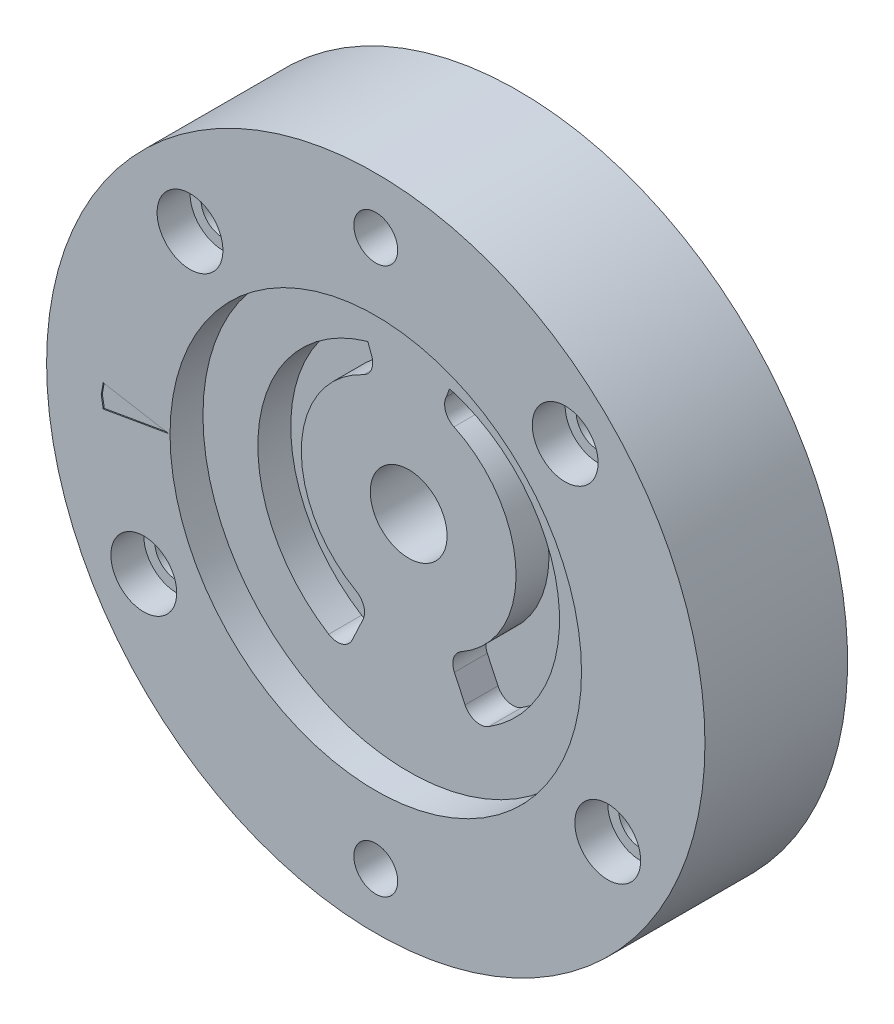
ISO-10303-21;
HEADER;
FILE_DESCRIPTION(('STEP AP214'),'2;1');
FILE_NAME('part.step','',(''),(''),'','','');
FILE_SCHEMA(('AUTOMOTIVE_DESIGN { 1 0 10303 214 1 1 1 1 }'));
ENDSEC;
DATA;
#1=APPLICATION_CONTEXT('core data for automotive mechanical design processes');
#2=APPLICATION_PROTOCOL_DEFINITION('international standard','automotive_design',2000,#1);
#3=PRODUCT_CONTEXT('',#1,'mechanical');
#4=PRODUCT('Part','Part','',(#3));
#5=PRODUCT_RELATED_PRODUCT_CATEGORY('part','',(#4));
#6=PRODUCT_DEFINITION_FORMATION('','',#4);
#7=PRODUCT_DEFINITION_CONTEXT('part definition',#1,'design');
#8=PRODUCT_DEFINITION('design','',#6,#7);
#9=PRODUCT_DEFINITION_SHAPE('','',#8);
#10=(LENGTH_UNIT() NAMED_UNIT(*) SI_UNIT(.MILLI.,.METRE.));
#11=(NAMED_UNIT(*) PLANE_ANGLE_UNIT() SI_UNIT($,.RADIAN.));
#12=(NAMED_UNIT(*) SI_UNIT($,.STERADIAN.) SOLID_ANGLE_UNIT());
#13=UNCERTAINTY_MEASURE_WITH_UNIT(LENGTH_MEASURE(1.E-05),#10,'distance_accuracy_value','');
#14=(GEOMETRIC_REPRESENTATION_CONTEXT(3) GLOBAL_UNCERTAINTY_ASSIGNED_CONTEXT((#13)) GLOBAL_UNIT_ASSIGNED_CONTEXT((#10,
#11,#12)) REPRESENTATION_CONTEXT('',''));
#15=CARTESIAN_POINT('',(0.,0.,0.));
#16=DIRECTION('',(0.,0.,1.));
#17=DIRECTION('',(1.,0.,0.));
#18=AXIS2_PLACEMENT_3D('',#15,#16,#17);
#19=CARTESIAN_POINT('',(-21.1403982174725,-12.2054146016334,3.));
#20=DIRECTION('',(0.,0.,-1.));
#21=DIRECTION('',(-1.,0.,0.));
#22=AXIS2_PLACEMENT_3D('',#19,#20,#21);
#23=CYLINDRICAL_SURFACE('',#22,2.00000000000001);
#24=CARTESIAN_POINT('',(-21.1403982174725,-12.2054146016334,-10.));
#25=DIRECTION('',(0.,0.,-1.));
#26=DIRECTION('',(-1.,0.,0.));
#27=AXIS2_PLACEMENT_3D('',#24,#25,#26);
#28=CIRCLE('',#27,2.00000000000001);
#29=CARTESIAN_POINT('',(-23.1403982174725,-12.2054146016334,-10.));
#30=VERTEX_POINT('',#29);
#31=EDGE_CURVE('E309',#30,#30,#28,.T.);
#32=ORIENTED_EDGE('',*,*,#31,.T.);
#33=EDGE_LOOP('',(#32));
#34=FACE_BOUND('',#33,.T.);
#35=CARTESIAN_POINT('',(-21.1403982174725,-12.2054146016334,0.));
#36=DIRECTION('',(0.,0.,1.));
#37=DIRECTION('',(1.,0.,0.));
#38=AXIS2_PLACEMENT_3D('',#35,#36,#37);
#39=CIRCLE('',#38,2.00000000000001);
#40=CARTESIAN_POINT('',(-19.1403982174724,-12.2054146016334,0.));
#41=VERTEX_POINT('',#40);
#42=EDGE_CURVE('E40',#41,#41,#39,.F.);
#43=ORIENTED_EDGE('',*,*,#42,.F.);
#44=EDGE_LOOP('',(#43));
#45=FACE_BOUND('',#44,.T.);
#46=ADVANCED_FACE('F36',(#34,#45),#23,.F.);
#47=CARTESIAN_POINT('',(21.1403982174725,-12.2054146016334,3.));
#48=DIRECTION('',(0.,0.,-1.));
#49=DIRECTION('',(-1.,0.,0.));
#50=AXIS2_PLACEMENT_3D('',#47,#48,#49);
#51=CYLINDRICAL_SURFACE('',#50,2.00000000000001);
#52=CARTESIAN_POINT('',(21.1403982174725,-12.2054146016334,-10.));
#53=DIRECTION('',(0.,0.,-1.));
#54=DIRECTION('',(1.,0.,0.));
#55=AXIS2_PLACEMENT_3D('',#52,#53,#54);
#56=CIRCLE('',#55,2.00000000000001);
#57=CARTESIAN_POINT('',(23.1403982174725,-12.2054146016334,-10.));
#58=VERTEX_POINT('',#57);
#59=EDGE_CURVE('E312',#58,#58,#56,.T.);
#60=ORIENTED_EDGE('',*,*,#59,.T.);
#61=EDGE_LOOP('',(#60));
#62=FACE_BOUND('',#61,.T.);
#63=CARTESIAN_POINT('',(21.1403982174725,-12.2054146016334,0.));
#64=DIRECTION('',(0.,0.,1.));
#65=DIRECTION('',(1.,0.,0.));
#66=AXIS2_PLACEMENT_3D('',#63,#64,#65);
#67=CIRCLE('',#66,2.00000000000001);
#68=CARTESIAN_POINT('',(23.1403982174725,-12.2054146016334,0.));
#69=VERTEX_POINT('',#68);
#70=EDGE_CURVE('E294',#69,#69,#67,.F.);
#71=ORIENTED_EDGE('',*,*,#70,.F.);
#72=EDGE_LOOP('',(#71));
#73=FACE_BOUND('',#72,.T.);
#74=ADVANCED_FACE('F388',(#62,#73),#51,.F.);
#75=CARTESIAN_POINT('',(17.2610628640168,17.2610628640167,3.));
#76=DIRECTION('',(0.,0.,-1.));
#77=DIRECTION('',(-1.,0.,0.));
#78=AXIS2_PLACEMENT_3D('',#75,#76,#77);
#79=CYLINDRICAL_SURFACE('',#78,2.00000000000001);
#80=CARTESIAN_POINT('',(17.2610628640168,17.2610628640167,-10.));
#81=DIRECTION('',(0.,0.,-1.));
#82=DIRECTION('',(-1.,0.,0.));
#83=AXIS2_PLACEMENT_3D('',#80,#81,#82);
#84=CIRCLE('',#83,2.00000000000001);
#85=CARTESIAN_POINT('',(15.2610628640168,17.2610628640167,-10.));
#86=VERTEX_POINT('',#85);
#87=EDGE_CURVE('E324',#86,#86,#84,.T.);
#88=ORIENTED_EDGE('',*,*,#87,.T.);
#89=EDGE_LOOP('',(#88));
#90=FACE_BOUND('',#89,.T.);
#91=CARTESIAN_POINT('',(17.2610628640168,17.2610628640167,0.));
#92=DIRECTION('',(0.,0.,1.));
#93=DIRECTION('',(1.,0.,0.));
#94=AXIS2_PLACEMENT_3D('',#91,#92,#93);
#95=CIRCLE('',#94,2.00000000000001);
#96=CARTESIAN_POINT('',(19.2610628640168,17.2610628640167,0.));
#97=VERTEX_POINT('',#96);
#98=EDGE_CURVE('E301',#97,#97,#95,.F.);
#99=ORIENTED_EDGE('',*,*,#98,.F.);
#100=EDGE_LOOP('',(#99));
#101=FACE_BOUND('',#100,.T.);
#102=ADVANCED_FACE('F390',(#90,#101),#79,.F.);
#103=CARTESIAN_POINT('',(-16.9287019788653,16.9287019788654,3.));
#104=DIRECTION('',(0.,0.,-1.));
#105=DIRECTION('',(-1.,0.,0.));
#106=AXIS2_PLACEMENT_3D('',#103,#104,#105);
#107=CYLINDRICAL_SURFACE('',#106,2.00000000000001);
#108=CARTESIAN_POINT('',(-16.9287019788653,16.9287019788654,-10.));
#109=DIRECTION('',(0.,0.,-1.));
#110=DIRECTION('',(1.,0.,0.));
#111=AXIS2_PLACEMENT_3D('',#108,#109,#110);
#112=CIRCLE('',#111,2.00000000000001);
#113=CARTESIAN_POINT('',(-14.9287019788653,16.9287019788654,-10.));
#114=VERTEX_POINT('',#113);
#115=EDGE_CURVE('E321',#114,#114,#112,.T.);
#116=ORIENTED_EDGE('',*,*,#115,.T.);
#117=EDGE_LOOP('',(#116));
#118=FACE_BOUND('',#117,.T.);
#119=CARTESIAN_POINT('',(-16.9287019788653,16.9287019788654,0.));
#120=DIRECTION('',(0.,0.,1.));
#121=DIRECTION('',(1.,0.,0.));
#122=AXIS2_PLACEMENT_3D('',#119,#120,#121);
#123=CIRCLE('',#122,2.00000000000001);
#124=CARTESIAN_POINT('',(-14.9287019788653,16.9287019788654,0.));
#125=VERTEX_POINT('',#124);
#126=EDGE_CURVE('E308',#125,#125,#123,.F.);
#127=ORIENTED_EDGE('',*,*,#126,.F.);
#128=EDGE_LOOP('',(#127));
#129=FACE_BOUND('',#128,.T.);
#130=ADVANCED_FACE('F397',(#118,#129),#107,.F.);
#131=CARTESIAN_POINT('',(0.,0.,3.));
#132=DIRECTION('',(0.,0.,1.));
#133=DIRECTION('',(1.,0.,0.));
#134=AXIS2_PLACEMENT_3D('',#131,#132,#133);
#135=PLANE('',#134);
#136=CARTESIAN_POINT('',(-21.1403982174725,-12.2054146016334,3.));
#137=DIRECTION('',(0.,0.,1.));
#138=DIRECTION('',(1.,0.,0.));
#139=AXIS2_PLACEMENT_3D('',#136,#137,#138);
#140=CIRCLE('',#139,3.);
#141=CARTESIAN_POINT('',(-18.1403982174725,-12.2054146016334,3.));
#142=VERTEX_POINT('',#141);
#143=EDGE_CURVE('E271',#142,#142,#140,.T.);
#144=ORIENTED_EDGE('',*,*,#143,.F.);
#145=EDGE_LOOP('',(#144));
#146=FACE_BOUND('',#145,.T.);
#147=CARTESIAN_POINT('',(21.1403982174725,-12.2054146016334,3.));
#148=DIRECTION('',(0.,0.,1.));
#149=DIRECTION('',(1.,0.,0.));
#150=AXIS2_PLACEMENT_3D('',#147,#148,#149);
#151=CIRCLE('',#150,3.);
#152=CARTESIAN_POINT('',(24.1403982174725,-12.2054146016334,3.));
#153=VERTEX_POINT('',#152);
#154=EDGE_CURVE('E288',#153,#153,#151,.T.);
#155=ORIENTED_EDGE('',*,*,#154,.F.);
#156=EDGE_LOOP('',(#155));
#157=FACE_BOUND('',#156,.T.);
#158=CARTESIAN_POINT('',(17.2610628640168,17.2610628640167,3.));
#159=DIRECTION('',(0.,0.,1.));
#160=DIRECTION('',(1.,0.,0.));
#161=AXIS2_PLACEMENT_3D('',#158,#159,#160);
#162=CIRCLE('',#161,3.);
#163=CARTESIAN_POINT('',(20.2610628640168,17.2610628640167,3.));
#164=VERTEX_POINT('',#163);
#165=EDGE_CURVE('E295',#164,#164,#162,.T.);
#166=ORIENTED_EDGE('',*,*,#165,.F.);
#167=EDGE_LOOP('',(#166));
#168=FACE_BOUND('',#167,.T.);
#169=CARTESIAN_POINT('',(-16.9287019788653,16.9287019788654,3.));
#170=DIRECTION('',(0.,0.,1.));
#171=DIRECTION('',(1.,0.,0.));
#172=AXIS2_PLACEMENT_3D('',#169,#170,#171);
#173=CIRCLE('',#172,3.);
#174=CARTESIAN_POINT('',(-13.9287019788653,16.9287019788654,3.));
#175=VERTEX_POINT('',#174);
#176=EDGE_CURVE('E302',#175,#175,#173,.T.);
#177=ORIENTED_EDGE('',*,*,#176,.F.);
#178=EDGE_LOOP('',(#177));
#179=FACE_BOUND('',#178,.T.);
#180=CARTESIAN_POINT('',(0.,-24.9027237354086,3.));
#181=DIRECTION('',(0.,0.,-1.));
#182=DIRECTION('',(1.,0.,0.));
#183=AXIS2_PLACEMENT_3D('',#180,#181,#182);
#184=CIRCLE('',#183,2.);
#185=CARTESIAN_POINT('',(2.,-24.9027237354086,3.));
#186=VERTEX_POINT('',#185);
#187=EDGE_CURVE('E318',#186,#186,#184,.T.);
#188=ORIENTED_EDGE('',*,*,#187,.T.);
#189=EDGE_LOOP('',(#188));
#190=FACE_BOUND('',#189,.T.);
#191=CARTESIAN_POINT('',(0.,24.9027237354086,3.));
#192=DIRECTION('',(0.,0.,-1.));
#193=DIRECTION('',(-1.,0.,0.));
#194=AXIS2_PLACEMENT_3D('',#191,#192,#193);
#195=CIRCLE('',#194,2.);
#196=CARTESIAN_POINT('',(-2.,24.9027237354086,3.));
#197=VERTEX_POINT('',#196);
#198=EDGE_CURVE('E330',#197,#197,#195,.T.);
#199=ORIENTED_EDGE('',*,*,#198,.T.);
#200=EDGE_LOOP('',(#199));
#201=FACE_BOUND('',#200,.T.);
#202=DIRECTION('',(0.985211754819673,0.171341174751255,0.));
#203=VECTOR('',#202,1.);
#204=CARTESIAN_POINT('',(-18.8715953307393,0.,3.));
#205=LINE('',#204,#203);
#206=CARTESIAN_POINT('',(-24.8378728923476,-1.0376134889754,3.));
#207=VERTEX_POINT('',#206);
#208=CARTESIAN_POINT('',(-18.8715953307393,0.,3.));
#209=VERTEX_POINT('',#208);
#210=EDGE_CURVE('E333',#207,#209,#205,.T.);
#211=ORIENTED_EDGE('',*,*,#210,.F.);
#212=DIRECTION('',(0.171341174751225,-0.985211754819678,0.));
#213=VECTOR('',#212,1.);
#214=CARTESIAN_POINT('',(-24.8378728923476,-1.0376134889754,3.));
#215=LINE('',#214,#213);
#216=CARTESIAN_POINT('',(-25.0183274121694,0.,3.));
#217=VERTEX_POINT('',#216);
#218=EDGE_CURVE('E341',#217,#207,#215,.T.);
#219=ORIENTED_EDGE('',*,*,#218,.F.);
#220=DIRECTION('',(-0.171341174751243,-0.985211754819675,0.));
#221=VECTOR('',#220,1.);
#222=CARTESIAN_POINT('',(-24.8378728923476,1.0376134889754,3.));
#223=LINE('',#222,#221);
#224=CARTESIAN_POINT('',(-24.8378728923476,1.0376134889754,3.));
#225=VERTEX_POINT('',#224);
#226=EDGE_CURVE('E338',#225,#217,#223,.T.);
#227=ORIENTED_EDGE('',*,*,#226,.F.);
#228=DIRECTION('',(-0.985211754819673,0.171341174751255,0.));
#229=VECTOR('',#228,1.);
#230=CARTESIAN_POINT('',(-18.8715953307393,0.,3.));
#231=LINE('',#230,#229);
#232=EDGE_CURVE('E335',#209,#225,#231,.T.);
#233=ORIENTED_EDGE('',*,*,#232,.F.);
#234=EDGE_LOOP('',(#211,#219,#227,#233));
#235=FACE_BOUND('',#234,.T.);
#236=CARTESIAN_POINT('',(0.,0.,3.));
#237=DIRECTION('',(0.,0.,1.));
#238=DIRECTION('',(1.,0.,0.));
#239=AXIS2_PLACEMENT_3D('',#236,#237,#238);
#240=CIRCLE('',#239,30.);
#241=CARTESIAN_POINT('',(30.,0.,3.));
#242=VERTEX_POINT('',#241);
#243=EDGE_CURVE('E12',#242,#242,#240,.T.);
#244=ORIENTED_EDGE('',*,*,#243,.T.);
#245=EDGE_LOOP('',(#244));
#246=FACE_BOUND('',#245,.T.);
#247=CARTESIAN_POINT('',(0.,0.,3.));
#248=DIRECTION('',(0.,0.,1.));
#249=DIRECTION('',(1.,0.,0.));
#250=AXIS2_PLACEMENT_3D('',#247,#248,#249);
#251=CIRCLE('',#250,18.75);
#252=CARTESIAN_POINT('',(18.75,0.,3.));
#253=VERTEX_POINT('',#252);
#254=EDGE_CURVE('E46',#253,#253,#251,.T.);
#255=ORIENTED_EDGE('',*,*,#254,.F.);
#256=EDGE_LOOP('',(#255));
#257=FACE_BOUND('',#256,.T.);
#258=ADVANCED_FACE('F411',(#146,#157,#168,#179,#190,#201,#235,#246,#257),#135,.T.);
#259=CARTESIAN_POINT('',(0.,0.,3.));
#260=DIRECTION('',(0.,0.,-1.));
#261=DIRECTION('',(-1.,0.,0.));
#262=AXIS2_PLACEMENT_3D('',#259,#260,#261);
#263=CYLINDRICAL_SURFACE('',#262,30.);
#264=ORIENTED_EDGE('',*,*,#243,.F.);
#265=EDGE_LOOP('',(#264));
#266=FACE_BOUND('',#265,.T.);
#267=CARTESIAN_POINT('',(0.,0.,-10.));
#268=DIRECTION('',(0.,0.,-1.));
#269=DIRECTION('',(-1.,0.,0.));
#270=AXIS2_PLACEMENT_3D('',#267,#268,#269);
#271=CIRCLE('',#270,30.);
#272=CARTESIAN_POINT('',(-30.,0.,-10.));
#273=VERTEX_POINT('',#272);
#274=EDGE_CURVE('E371',#273,#273,#271,.T.);
#275=ORIENTED_EDGE('',*,*,#274,.F.);
#276=EDGE_LOOP('',(#275));
#277=FACE_BOUND('',#276,.T.);
#278=ADVANCED_FACE('F38',(#266,#277),#263,.T.);
#279=CARTESIAN_POINT('',(0.,0.,3.));
#280=DIRECTION('',(0.,0.,-1.));
#281=DIRECTION('',(-1.,0.,0.));
#282=AXIS2_PLACEMENT_3D('',#279,#280,#281);
#283=CYLINDRICAL_SURFACE('',#282,18.75);
#284=ORIENTED_EDGE('',*,*,#254,.T.);
#285=EDGE_LOOP('',(#284));
#286=FACE_BOUND('',#285,.T.);
#287=CARTESIAN_POINT('',(0.,0.,0.));
#288=DIRECTION('',(0.,0.,1.));
#289=DIRECTION('',(1.,0.,0.));
#290=AXIS2_PLACEMENT_3D('',#287,#288,#289);
#291=CIRCLE('',#290,18.75);
#292=CARTESIAN_POINT('',(18.75,0.,0.));
#293=VERTEX_POINT('',#292);
#294=EDGE_CURVE('E374',#293,#293,#291,.T.);
#295=ORIENTED_EDGE('',*,*,#294,.F.);
#296=EDGE_LOOP('',(#295));
#297=FACE_BOUND('',#296,.T.);
#298=ADVANCED_FACE('F446',(#286,#297),#283,.F.);
#299=CARTESIAN_POINT('',(0.,0.,-10.));
#300=DIRECTION('',(0.,0.,-1.));
#301=DIRECTION('',(-1.,0.,0.));
#302=AXIS2_PLACEMENT_3D('',#299,#300,#301);
#303=PLANE('',#302);
#304=ORIENTED_EDGE('',*,*,#31,.F.);
#305=EDGE_LOOP('',(#304));
#306=FACE_BOUND('',#305,.T.);
#307=ORIENTED_EDGE('',*,*,#59,.F.);
#308=EDGE_LOOP('',(#307));
#309=FACE_BOUND('',#308,.T.);
#310=CARTESIAN_POINT('',(0.,-24.9027237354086,-10.));
#311=DIRECTION('',(0.,0.,-1.));
#312=DIRECTION('',(1.,0.,0.));
#313=AXIS2_PLACEMENT_3D('',#310,#311,#312);
#314=CIRCLE('',#313,2.);
#315=CARTESIAN_POINT('',(2.,-24.9027237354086,-10.));
#316=VERTEX_POINT('',#315);
#317=EDGE_CURVE('E315',#316,#316,#314,.T.);
#318=ORIENTED_EDGE('',*,*,#317,.F.);
#319=EDGE_LOOP('',(#318));
#320=FACE_BOUND('',#319,.T.);
#321=ORIENTED_EDGE('',*,*,#115,.F.);
#322=EDGE_LOOP('',(#321));
#323=FACE_BOUND('',#322,.T.);
#324=ORIENTED_EDGE('',*,*,#87,.F.);
#325=EDGE_LOOP('',(#324));
#326=FACE_BOUND('',#325,.T.);
#327=CARTESIAN_POINT('',(0.,24.9027237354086,-10.));
#328=DIRECTION('',(0.,0.,-1.));
#329=DIRECTION('',(-1.,0.,0.));
#330=AXIS2_PLACEMENT_3D('',#327,#328,#329);
#331=CIRCLE('',#330,2.);
#332=CARTESIAN_POINT('',(-2.,24.9027237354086,-10.));
#333=VERTEX_POINT('',#332);
#334=EDGE_CURVE('E327',#333,#333,#331,.T.);
#335=ORIENTED_EDGE('',*,*,#334,.F.);
#336=EDGE_LOOP('',(#335));
#337=FACE_BOUND('',#336,.T.);
#338=ORIENTED_EDGE('',*,*,#274,.T.);
#339=EDGE_LOOP('',(#338));
#340=FACE_BOUND('',#339,.T.);
#341=CARTESIAN_POINT('',(0.,1.6,-10.));
#342=DIRECTION('',(0.,0.,-1.));
#343=DIRECTION('',(-1.,0.,0.));
#344=AXIS2_PLACEMENT_3D('',#341,#342,#343);
#345=CIRCLE('',#344,3.5);
#346=CARTESIAN_POINT('',(-3.5,1.6,-10.));
#347=VERTEX_POINT('',#346);
#348=EDGE_CURVE('E368',#347,#347,#345,.T.);
#349=ORIENTED_EDGE('',*,*,#348,.F.);
#350=EDGE_LOOP('',(#349));
#351=FACE_BOUND('',#350,.T.);
#352=ADVANCED_FACE('F443',(#306,#309,#320,#323,#326,#337,#340,#351),#303,.T.);
#353=CARTESIAN_POINT('',(0.,0.,0.));
#354=DIRECTION('',(0.,0.,-1.));
#355=DIRECTION('',(-1.,0.,0.));
#356=AXIS2_PLACEMENT_3D('',#353,#354,#355);
#357=PLANE('',#356);
#358=DIRECTION('',(0.422618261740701,-0.906307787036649,0.));
#359=VECTOR('',#358,1.);
#360=CARTESIAN_POINT('',(4.16463917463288,-8.81825706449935,0.));
#361=LINE('',#360,#359);
#362=CARTESIAN_POINT('',(4.16463917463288,-8.81825706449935,0.));
#363=VERTEX_POINT('',#362);
#364=CARTESIAN_POINT('',(5.13698260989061,-10.9034542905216,0.));
#365=VERTEX_POINT('',#364);
#366=EDGE_CURVE('E178',#363,#365,#361,.T.);
#367=ORIENTED_EDGE('',*,*,#366,.F.);
#368=CARTESIAN_POINT('',(5.52410085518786,-8.18432967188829,0.));
#369=DIRECTION('',(0.,0.,1.));
#370=DIRECTION('',(-1.,0.,0.));
#371=AXIS2_PLACEMENT_3D('',#368,#369,#370);
#372=CIRCLE('',#371,1.5);
#373=CARTESIAN_POINT('',(4.78989806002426,-6.87629822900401,0.));
#374=VERTEX_POINT('',#373);
#375=EDGE_CURVE('E53',#374,#363,#372,.T.);
#376=ORIENTED_EDGE('',*,*,#375,.F.);
#377=CARTESIAN_POINT('',(0.,1.65722590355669,0.));
#378=DIRECTION('',(0.,0.,-1.));
#379=DIRECTION('',(-1.,0.,0.));
#380=AXIS2_PLACEMENT_3D('',#377,#378,#379);
#381=CIRCLE('',#380,9.78591628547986);
#382=CARTESIAN_POINT('',(4.12384270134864,10.53180076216,0.));
#383=VERTEX_POINT('',#382);
#384=EDGE_CURVE('E197',#383,#374,#381,.T.);
#385=ORIENTED_EDGE('',*,*,#384,.F.);
#386=CARTESIAN_POINT('',(4.77508505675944,11.8830532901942,0.));
#387=DIRECTION('',(0.,0.,1.));
#388=DIRECTION('',(1.,0.,0.));
#389=AXIS2_PLACEMENT_3D('',#386,#387,#388);
#390=CIRCLE('',#389,1.5);
#391=CARTESIAN_POINT('',(3.43996672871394,12.5667630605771,0.));
#392=VERTEX_POINT('',#391);
#393=EDGE_CURVE('E194',#392,#383,#390,.T.);
#394=ORIENTED_EDGE('',*,*,#393,.F.);
#395=DIRECTION('',(-0.342020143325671,-0.939692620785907,0.));
#396=VECTOR('',#395,1.);
#397=CARTESIAN_POINT('',(3.43996672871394,12.5667630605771,0.));
#398=LINE('',#397,#396);
#399=CARTESIAN_POINT('',(3.72368256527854,13.34626591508,0.));
#400=VERTEX_POINT('',#399);
#401=EDGE_CURVE('E188',#400,#392,#398,.T.);
#402=ORIENTED_EDGE('',*,*,#401,.F.);
#403=CARTESIAN_POINT('',(0.,0.112840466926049,0.));
#404=DIRECTION('',(0.,0.,1.));
#405=DIRECTION('',(1.,0.,0.));
#406=AXIS2_PLACEMENT_3D('',#403,#404,#405);
#407=CIRCLE('',#406,13.7473401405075);
#408=CARTESIAN_POINT('',(7.29210002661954,-11.5411132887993,0.));
#409=VERTEX_POINT('',#408);
#410=EDGE_CURVE('E186',#409,#400,#407,.T.);
#411=ORIENTED_EDGE('',*,*,#410,.F.);
#412=CARTESIAN_POINT('',(6.49644429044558,-10.2695268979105,0.));
#413=DIRECTION('',(0.,0.,1.));
#414=DIRECTION('',(1.,0.,0.));
#415=AXIS2_PLACEMENT_3D('',#412,#413,#414);
#416=CIRCLE('',#415,1.5);
#417=EDGE_CURVE('E167',#365,#409,#416,.T.);
#418=ORIENTED_EDGE('',*,*,#417,.F.);
#419=EDGE_LOOP('',(#367,#376,#385,#394,#402,#411,#418));
#420=FACE_BOUND('',#419,.T.);
#421=DIRECTION('',(0.422618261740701,0.906307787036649,0.));
#422=VECTOR('',#421,1.);
#423=CARTESIAN_POINT('',(-4.16463917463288,-8.81825706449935,0.));
#424=LINE('',#423,#422);
#425=CARTESIAN_POINT('',(-5.1369826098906,-10.9034542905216,0.));
#426=VERTEX_POINT('',#425);
#427=CARTESIAN_POINT('',(-4.16463917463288,-8.81825706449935,0.));
#428=VERTEX_POINT('',#427);
#429=EDGE_CURVE('E229',#426,#428,#424,.T.);
#430=ORIENTED_EDGE('',*,*,#429,.F.);
#431=CARTESIAN_POINT('',(-6.49644429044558,-10.2695268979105,0.));
#432=DIRECTION('',(0.,0.,1.));
#433=DIRECTION('',(-1.,0.,0.));
#434=AXIS2_PLACEMENT_3D('',#431,#432,#433);
#435=CIRCLE('',#434,1.5);
#436=CARTESIAN_POINT('',(-7.29210002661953,-11.5411132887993,0.));
#437=VERTEX_POINT('',#436);
#438=EDGE_CURVE('E61',#437,#426,#435,.T.);
#439=ORIENTED_EDGE('',*,*,#438,.F.);
#440=CARTESIAN_POINT('',(0.,0.112840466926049,0.));
#441=DIRECTION('',(0.,0.,1.));
#442=DIRECTION('',(-1.,0.,0.));
#443=AXIS2_PLACEMENT_3D('',#440,#441,#442);
#444=CIRCLE('',#443,13.7473401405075);
#445=CARTESIAN_POINT('',(-3.72368256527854,13.34626591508,0.));
#446=VERTEX_POINT('',#445);
#447=EDGE_CURVE('E244',#446,#437,#444,.T.);
#448=ORIENTED_EDGE('',*,*,#447,.F.);
#449=DIRECTION('',(-0.342020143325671,0.939692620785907,0.));
#450=VECTOR('',#449,1.);
#451=CARTESIAN_POINT('',(-3.43996672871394,12.5667630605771,0.));
#452=LINE('',#451,#450);
#453=CARTESIAN_POINT('',(-3.43996672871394,12.5667630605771,0.));
#454=VERTEX_POINT('',#453);
#455=EDGE_CURVE('E241',#454,#446,#452,.T.);
#456=ORIENTED_EDGE('',*,*,#455,.F.);
#457=CARTESIAN_POINT('',(-4.77508505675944,11.8830532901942,0.));
#458=DIRECTION('',(0.,0.,1.));
#459=DIRECTION('',(-1.,0.,0.));
#460=AXIS2_PLACEMENT_3D('',#457,#458,#459);
#461=CIRCLE('',#460,1.5);
#462=CARTESIAN_POINT('',(-4.12384270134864,10.53180076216,0.));
#463=VERTEX_POINT('',#462);
#464=EDGE_CURVE('E238',#463,#454,#461,.T.);
#465=ORIENTED_EDGE('',*,*,#464,.F.);
#466=CARTESIAN_POINT('',(0.,1.65722590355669,0.));
#467=DIRECTION('',(0.,0.,-1.));
#468=DIRECTION('',(1.,0.,0.));
#469=AXIS2_PLACEMENT_3D('',#466,#467,#468);
#470=CIRCLE('',#469,9.78591628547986);
#471=CARTESIAN_POINT('',(-4.78989806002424,-6.87629822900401,0.));
#472=VERTEX_POINT('',#471);
#473=EDGE_CURVE('E235',#472,#463,#470,.T.);
#474=ORIENTED_EDGE('',*,*,#473,.F.);
#475=CARTESIAN_POINT('',(-5.52410085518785,-8.1843296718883,0.));
#476=DIRECTION('',(0.,0.,1.));
#477=DIRECTION('',(1.,0.,0.));
#478=AXIS2_PLACEMENT_3D('',#475,#476,#477);
#479=CIRCLE('',#478,1.5);
#480=EDGE_CURVE('E232',#428,#472,#479,.T.);
#481=ORIENTED_EDGE('',*,*,#480,.F.);
#482=EDGE_LOOP('',(#430,#439,#448,#456,#465,#474,#481));
#483=FACE_BOUND('',#482,.T.);
#484=ORIENTED_EDGE('',*,*,#294,.T.);
#485=EDGE_LOOP('',(#484));
#486=FACE_BOUND('',#485,.T.);
#487=CARTESIAN_POINT('',(0.,1.6,0.));
#488=DIRECTION('',(0.,0.,-1.));
#489=DIRECTION('',(-1.,0.,0.));
#490=AXIS2_PLACEMENT_3D('',#487,#488,#489);
#491=CIRCLE('',#490,3.5);
#492=CARTESIAN_POINT('',(-3.5,1.6,0.));
#493=VERTEX_POINT('',#492);
#494=EDGE_CURVE('E359',#493,#493,#491,.T.);
#495=ORIENTED_EDGE('',*,*,#494,.T.);
#496=EDGE_LOOP('',(#495));
#497=FACE_BOUND('',#496,.T.);
#498=ADVANCED_FACE('F182',(#420,#483,#486,#497),#357,.F.);
#499=CARTESIAN_POINT('',(0.,1.6,-10.));
#500=DIRECTION('',(0.,0.,1.));
#501=DIRECTION('',(1.,0.,0.));
#502=AXIS2_PLACEMENT_3D('',#499,#500,#501);
#503=CYLINDRICAL_SURFACE('',#502,3.5);
#504=ORIENTED_EDGE('',*,*,#348,.T.);
#505=EDGE_LOOP('',(#504));
#506=FACE_BOUND('',#505,.T.);
#507=ORIENTED_EDGE('',*,*,#494,.F.);
#508=EDGE_LOOP('',(#507));
#509=FACE_BOUND('',#508,.T.);
#510=ADVANCED_FACE('F436',(#506,#509),#503,.F.);
#511=CARTESIAN_POINT('',(-18.8715953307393,0.,2.9));
#512=DIRECTION('',(0.171341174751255,-0.985211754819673,0.));
#513=DIRECTION('',(0.985211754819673,0.171341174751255,0.));
#514=AXIS2_PLACEMENT_3D('',#511,#512,#513);
#515=PLANE('',#514);
#516=ORIENTED_EDGE('',*,*,#210,.T.);
#517=DIRECTION('',(0.,0.,1.));
#518=VECTOR('',#517,1.);
#519=CARTESIAN_POINT('',(-18.8715953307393,0.,2.9));
#520=LINE('',#519,#518);
#521=CARTESIAN_POINT('',(-18.8715953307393,0.,2.9));
#522=VERTEX_POINT('',#521);
#523=EDGE_CURVE('E356',#522,#209,#520,.T.);
#524=ORIENTED_EDGE('',*,*,#523,.F.);
#525=DIRECTION('',(0.985211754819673,0.171341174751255,0.));
#526=VECTOR('',#525,1.);
#527=CARTESIAN_POINT('',(-18.8715953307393,0.,2.9));
#528=LINE('',#527,#526);
#529=CARTESIAN_POINT('',(-24.8378728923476,-1.0376134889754,2.9));
#530=VERTEX_POINT('',#529);
#531=EDGE_CURVE('E344',#530,#522,#528,.T.);
#532=ORIENTED_EDGE('',*,*,#531,.F.);
#533=DIRECTION('',(0.,0.,1.));
#534=VECTOR('',#533,1.);
#535=CARTESIAN_POINT('',(-24.8378728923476,-1.0376134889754,2.9));
#536=LINE('',#535,#534);
#537=EDGE_CURVE('E357',#530,#207,#536,.T.);
#538=ORIENTED_EDGE('',*,*,#537,.T.);
#539=EDGE_LOOP('',(#516,#524,#532,#538));
#540=FACE_BOUND('',#539,.T.);
#541=ADVANCED_FACE('F426',(#540),#515,.F.);
#542=CARTESIAN_POINT('',(-24.8378728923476,-1.0376134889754,2.9));
#543=DIRECTION('',(-0.985211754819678,-0.171341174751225,0.));
#544=DIRECTION('',(0.171341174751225,-0.985211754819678,0.));
#545=AXIS2_PLACEMENT_3D('',#542,#543,#544);
#546=PLANE('',#545);
#547=ORIENTED_EDGE('',*,*,#218,.T.);
#548=ORIENTED_EDGE('',*,*,#537,.F.);
#549=DIRECTION('',(0.171341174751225,-0.985211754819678,0.));
#550=VECTOR('',#549,1.);
#551=CARTESIAN_POINT('',(-24.8378728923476,-1.0376134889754,2.9));
#552=LINE('',#551,#550);
#553=CARTESIAN_POINT('',(-25.0183274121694,0.,2.9));
#554=VERTEX_POINT('',#553);
#555=EDGE_CURVE('E353',#554,#530,#552,.T.);
#556=ORIENTED_EDGE('',*,*,#555,.F.);
#557=DIRECTION('',(0.,0.,1.));
#558=VECTOR('',#557,1.);
#559=CARTESIAN_POINT('',(-25.0183274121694,0.,2.9));
#560=LINE('',#559,#558);
#561=EDGE_CURVE('E360',#554,#217,#560,.T.);
#562=ORIENTED_EDGE('',*,*,#561,.T.);
#563=EDGE_LOOP('',(#547,#548,#556,#562));
#564=FACE_BOUND('',#563,.T.);
#565=ADVANCED_FACE('F422',(#564),#546,.F.);
#566=CARTESIAN_POINT('',(-24.8378728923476,1.0376134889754,2.9));
#567=DIRECTION('',(-0.985211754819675,0.171341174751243,0.));
#568=DIRECTION('',(-0.171341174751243,-0.985211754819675,0.));
#569=AXIS2_PLACEMENT_3D('',#566,#567,#568);
#570=PLANE('',#569);
#571=ORIENTED_EDGE('',*,*,#226,.T.);
#572=ORIENTED_EDGE('',*,*,#561,.F.);
#573=DIRECTION('',(-0.171341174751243,-0.985211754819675,0.));
#574=VECTOR('',#573,1.);
#575=CARTESIAN_POINT('',(-24.8378728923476,1.0376134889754,2.9));
#576=LINE('',#575,#574);
#577=CARTESIAN_POINT('',(-24.8378728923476,1.0376134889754,2.9));
#578=VERTEX_POINT('',#577);
#579=EDGE_CURVE('E350',#578,#554,#576,.T.);
#580=ORIENTED_EDGE('',*,*,#579,.F.);
#581=DIRECTION('',(0.,0.,1.));
#582=VECTOR('',#581,1.);
#583=CARTESIAN_POINT('',(-24.8378728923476,1.0376134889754,2.9));
#584=LINE('',#583,#582);
#585=EDGE_CURVE('E362',#578,#225,#584,.T.);
#586=ORIENTED_EDGE('',*,*,#585,.T.);
#587=EDGE_LOOP('',(#571,#572,#580,#586));
#588=FACE_BOUND('',#587,.T.);
#589=ADVANCED_FACE('F425',(#588),#570,.F.);
#590=CARTESIAN_POINT('',(-18.8715953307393,0.,2.9));
#591=DIRECTION('',(0.171341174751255,0.985211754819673,0.));
#592=DIRECTION('',(-0.985211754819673,0.171341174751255,0.));
#593=AXIS2_PLACEMENT_3D('',#590,#591,#592);
#594=PLANE('',#593);
#595=ORIENTED_EDGE('',*,*,#232,.T.);
#596=ORIENTED_EDGE('',*,*,#585,.F.);
#597=DIRECTION('',(-0.985211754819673,0.171341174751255,0.));
#598=VECTOR('',#597,1.);
#599=CARTESIAN_POINT('',(-18.8715953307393,0.,2.9));
#600=LINE('',#599,#598);
#601=EDGE_CURVE('E347',#522,#578,#600,.T.);
#602=ORIENTED_EDGE('',*,*,#601,.F.);
#603=ORIENTED_EDGE('',*,*,#523,.T.);
#604=EDGE_LOOP('',(#595,#596,#602,#603));
#605=FACE_BOUND('',#604,.T.);
#606=ADVANCED_FACE('F420',(#605),#594,.F.);
#607=CARTESIAN_POINT('',(-24.8378728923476,-1.0376134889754,2.9));
#608=DIRECTION('',(0.,0.,-1.));
#609=DIRECTION('',(-1.,0.,0.));
#610=AXIS2_PLACEMENT_3D('',#607,#608,#609);
#611=PLANE('',#610);
#612=ORIENTED_EDGE('',*,*,#531,.T.);
#613=ORIENTED_EDGE('',*,*,#601,.T.);
#614=ORIENTED_EDGE('',*,*,#579,.T.);
#615=ORIENTED_EDGE('',*,*,#555,.T.);
#616=EDGE_LOOP('',(#612,#613,#614,#615));
#617=FACE_BOUND('',#616,.T.);
#618=ADVANCED_FACE('F416',(#617),#611,.F.);
#619=CARTESIAN_POINT('',(0.,24.9027237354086,3.));
#620=DIRECTION('',(0.,0.,-1.));
#621=DIRECTION('',(-1.,0.,0.));
#622=AXIS2_PLACEMENT_3D('',#619,#620,#621);
#623=CYLINDRICAL_SURFACE('',#622,2.);
#624=ORIENTED_EDGE('',*,*,#198,.F.);
#625=EDGE_LOOP('',(#624));
#626=FACE_BOUND('',#625,.T.);
#627=ORIENTED_EDGE('',*,*,#334,.T.);
#628=EDGE_LOOP('',(#627));
#629=FACE_BOUND('',#628,.T.);
#630=ADVANCED_FACE('F408',(#626,#629),#623,.F.);
#631=CARTESIAN_POINT('',(0.,-24.9027237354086,3.));
#632=DIRECTION('',(0.,0.,-1.));
#633=DIRECTION('',(-1.,0.,0.));
#634=AXIS2_PLACEMENT_3D('',#631,#632,#633);
#635=CYLINDRICAL_SURFACE('',#634,2.);
#636=ORIENTED_EDGE('',*,*,#187,.F.);
#637=EDGE_LOOP('',(#636));
#638=FACE_BOUND('',#637,.T.);
#639=ORIENTED_EDGE('',*,*,#317,.T.);
#640=EDGE_LOOP('',(#639));
#641=FACE_BOUND('',#640,.T.);
#642=ADVANCED_FACE('F404',(#638,#641),#635,.F.);
#643=CARTESIAN_POINT('',(-16.9287019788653,16.9287019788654,0.));
#644=DIRECTION('',(0.,0.,1.));
#645=DIRECTION('',(1.,0.,0.));
#646=AXIS2_PLACEMENT_3D('',#643,#644,#645);
#647=PLANE('',#646);
#648=CARTESIAN_POINT('',(-16.9287019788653,16.9287019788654,0.));
#649=DIRECTION('',(0.,0.,1.));
#650=DIRECTION('',(1.,0.,0.));
#651=AXIS2_PLACEMENT_3D('',#648,#649,#650);
#652=CIRCLE('',#651,3.);
#653=CARTESIAN_POINT('',(-13.9287019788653,16.9287019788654,0.));
#654=VERTEX_POINT('',#653);
#655=EDGE_CURVE('E305',#654,#654,#652,.T.);
#656=ORIENTED_EDGE('',*,*,#655,.T.);
#657=EDGE_LOOP('',(#656));
#658=FACE_BOUND('',#657,.T.);
#659=ORIENTED_EDGE('',*,*,#126,.T.);
#660=EDGE_LOOP('',(#659));
#661=FACE_BOUND('',#660,.T.);
#662=ADVANCED_FACE('F407',(#658,#661),#647,.T.);
#663=CARTESIAN_POINT('',(-16.9287019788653,16.9287019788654,0.));
#664=DIRECTION('',(0.,0.,1.));
#665=DIRECTION('',(1.,0.,0.));
#666=AXIS2_PLACEMENT_3D('',#663,#664,#665);
#667=CYLINDRICAL_SURFACE('',#666,3.);
#668=ORIENTED_EDGE('',*,*,#655,.F.);
#669=EDGE_LOOP('',(#668));
#670=FACE_BOUND('',#669,.T.);
#671=ORIENTED_EDGE('',*,*,#176,.T.);
#672=EDGE_LOOP('',(#671));
#673=FACE_BOUND('',#672,.T.);
#674=ADVANCED_FACE('F506',(#670,#673),#667,.F.);
#675=CARTESIAN_POINT('',(17.2610628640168,17.2610628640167,0.));
#676=DIRECTION('',(0.,0.,1.));
#677=DIRECTION('',(1.,0.,0.));
#678=AXIS2_PLACEMENT_3D('',#675,#676,#677);
#679=PLANE('',#678);
#680=CARTESIAN_POINT('',(17.2610628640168,17.2610628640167,0.));
#681=DIRECTION('',(0.,0.,1.));
#682=DIRECTION('',(1.,0.,0.));
#683=AXIS2_PLACEMENT_3D('',#680,#681,#682);
#684=CIRCLE('',#683,3.);
#685=CARTESIAN_POINT('',(20.2610628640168,17.2610628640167,0.));
#686=VERTEX_POINT('',#685);
#687=EDGE_CURVE('E298',#686,#686,#684,.T.);
#688=ORIENTED_EDGE('',*,*,#687,.T.);
#689=EDGE_LOOP('',(#688));
#690=FACE_BOUND('',#689,.T.);
#691=ORIENTED_EDGE('',*,*,#98,.T.);
#692=EDGE_LOOP('',(#691));
#693=FACE_BOUND('',#692,.T.);
#694=ADVANCED_FACE('F503',(#690,#693),#679,.T.);
#695=CARTESIAN_POINT('',(17.2610628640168,17.2610628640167,0.));
#696=DIRECTION('',(0.,0.,1.));
#697=DIRECTION('',(1.,0.,0.));
#698=AXIS2_PLACEMENT_3D('',#695,#696,#697);
#699=CYLINDRICAL_SURFACE('',#698,3.);
#700=ORIENTED_EDGE('',*,*,#687,.F.);
#701=EDGE_LOOP('',(#700));
#702=FACE_BOUND('',#701,.T.);
#703=ORIENTED_EDGE('',*,*,#165,.T.);
#704=EDGE_LOOP('',(#703));
#705=FACE_BOUND('',#704,.T.);
#706=ADVANCED_FACE('F505',(#702,#705),#699,.F.);
#707=CARTESIAN_POINT('',(21.1403982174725,-12.2054146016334,0.));
#708=DIRECTION('',(0.,0.,1.));
#709=DIRECTION('',(1.,0.,0.));
#710=AXIS2_PLACEMENT_3D('',#707,#708,#709);
#711=PLANE('',#710);
#712=CARTESIAN_POINT('',(21.1403982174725,-12.2054146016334,0.));
#713=DIRECTION('',(0.,0.,1.));
#714=DIRECTION('',(1.,0.,0.));
#715=AXIS2_PLACEMENT_3D('',#712,#713,#714);
#716=CIRCLE('',#715,3.);
#717=CARTESIAN_POINT('',(24.1403982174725,-12.2054146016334,0.));
#718=VERTEX_POINT('',#717);
#719=EDGE_CURVE('E291',#718,#718,#716,.T.);
#720=ORIENTED_EDGE('',*,*,#719,.T.);
#721=EDGE_LOOP('',(#720));
#722=FACE_BOUND('',#721,.T.);
#723=ORIENTED_EDGE('',*,*,#70,.T.);
#724=EDGE_LOOP('',(#723));
#725=FACE_BOUND('',#724,.T.);
#726=ADVANCED_FACE('F386',(#722,#725),#711,.T.);
#727=CARTESIAN_POINT('',(21.1403982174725,-12.2054146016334,0.));
#728=DIRECTION('',(0.,0.,1.));
#729=DIRECTION('',(1.,0.,0.));
#730=AXIS2_PLACEMENT_3D('',#727,#728,#729);
#731=CYLINDRICAL_SURFACE('',#730,3.);
#732=ORIENTED_EDGE('',*,*,#719,.F.);
#733=EDGE_LOOP('',(#732));
#734=FACE_BOUND('',#733,.T.);
#735=ORIENTED_EDGE('',*,*,#154,.T.);
#736=EDGE_LOOP('',(#735));
#737=FACE_BOUND('',#736,.T.);
#738=ADVANCED_FACE('F517',(#734,#737),#731,.F.);
#739=CARTESIAN_POINT('',(-21.1403982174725,-12.2054146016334,0.));
#740=DIRECTION('',(0.,0.,1.));
#741=DIRECTION('',(1.,0.,0.));
#742=AXIS2_PLACEMENT_3D('',#739,#740,#741);
#743=PLANE('',#742);
#744=CARTESIAN_POINT('',(-21.1403982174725,-12.2054146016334,0.));
#745=DIRECTION('',(0.,0.,1.));
#746=DIRECTION('',(1.,0.,0.));
#747=AXIS2_PLACEMENT_3D('',#744,#745,#746);
#748=CIRCLE('',#747,3.);
#749=CARTESIAN_POINT('',(-18.1403982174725,-12.2054146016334,0.));
#750=VERTEX_POINT('',#749);
#751=EDGE_CURVE('E285',#750,#750,#748,.T.);
#752=ORIENTED_EDGE('',*,*,#751,.T.);
#753=EDGE_LOOP('',(#752));
#754=FACE_BOUND('',#753,.T.);
#755=ORIENTED_EDGE('',*,*,#42,.T.);
#756=EDGE_LOOP('',(#755));
#757=FACE_BOUND('',#756,.T.);
#758=ADVANCED_FACE('F555',(#754,#757),#743,.T.);
#759=CARTESIAN_POINT('',(-21.1403982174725,-12.2054146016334,0.));
#760=DIRECTION('',(0.,0.,1.));
#761=DIRECTION('',(1.,0.,0.));
#762=AXIS2_PLACEMENT_3D('',#759,#760,#761);
#763=CYLINDRICAL_SURFACE('',#762,3.);
#764=ORIENTED_EDGE('',*,*,#751,.F.);
#765=EDGE_LOOP('',(#764));
#766=FACE_BOUND('',#765,.T.);
#767=ORIENTED_EDGE('',*,*,#143,.T.);
#768=EDGE_LOOP('',(#767));
#769=FACE_BOUND('',#768,.T.);
#770=ADVANCED_FACE('F562',(#766,#769),#763,.F.);
#771=CARTESIAN_POINT('',(-6.49644429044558,-10.2695268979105,-3.));
#772=DIRECTION('',(0.,0.,1.));
#773=DIRECTION('',(1.,0.,0.));
#774=AXIS2_PLACEMENT_3D('',#771,#772,#773);
#775=CYLINDRICAL_SURFACE('',#774,1.5);
#776=ORIENTED_EDGE('',*,*,#438,.T.);
#777=DIRECTION('',(0.,0.,1.));
#778=VECTOR('',#777,1.);
#779=CARTESIAN_POINT('',(-5.1369826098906,-10.9034542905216,-3.));
#780=LINE('',#779,#778);
#781=CARTESIAN_POINT('',(-5.1369826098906,-10.9034542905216,-3.));
#782=VERTEX_POINT('',#781);
#783=EDGE_CURVE('E268',#782,#426,#780,.T.);
#784=ORIENTED_EDGE('',*,*,#783,.F.);
#785=CARTESIAN_POINT('',(-6.49644429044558,-10.2695268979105,-3.));
#786=DIRECTION('',(0.,0.,1.));
#787=DIRECTION('',(-1.,0.,0.));
#788=AXIS2_PLACEMENT_3D('',#785,#786,#787);
#789=CIRCLE('',#788,1.5);
#790=CARTESIAN_POINT('',(-7.29210002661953,-11.5411132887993,-3.));
#791=VERTEX_POINT('',#790);
#792=EDGE_CURVE('E247',#791,#782,#789,.T.);
#793=ORIENTED_EDGE('',*,*,#792,.F.);
#794=DIRECTION('',(0.,0.,1.));
#795=VECTOR('',#794,1.);
#796=CARTESIAN_POINT('',(-7.29210002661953,-11.5411132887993,-3.));
#797=LINE('',#796,#795);
#798=EDGE_CURVE('E269',#791,#437,#797,.T.);
#799=ORIENTED_EDGE('',*,*,#798,.T.);
#800=EDGE_LOOP('',(#776,#784,#793,#799));
#801=FACE_BOUND('',#800,.T.);
#802=ADVANCED_FACE('F570',(#801),#775,.F.);
#803=CARTESIAN_POINT('',(0.,0.112840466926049,-3.));
#804=DIRECTION('',(0.,0.,1.));
#805=DIRECTION('',(1.,0.,0.));
#806=AXIS2_PLACEMENT_3D('',#803,#804,#805);
#807=CYLINDRICAL_SURFACE('',#806,13.7473401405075);
#808=ORIENTED_EDGE('',*,*,#447,.T.);
#809=ORIENTED_EDGE('',*,*,#798,.F.);
#810=CARTESIAN_POINT('',(0.,0.112840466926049,-3.));
#811=DIRECTION('',(0.,0.,1.));
#812=DIRECTION('',(-1.,0.,0.));
#813=AXIS2_PLACEMENT_3D('',#810,#811,#812);
#814=CIRCLE('',#813,13.7473401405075);
#815=CARTESIAN_POINT('',(-3.72368256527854,13.34626591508,-3.));
#816=VERTEX_POINT('',#815);
#817=EDGE_CURVE('E265',#816,#791,#814,.T.);
#818=ORIENTED_EDGE('',*,*,#817,.F.);
#819=DIRECTION('',(0.,0.,1.));
#820=VECTOR('',#819,1.);
#821=CARTESIAN_POINT('',(-3.72368256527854,13.34626591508,-3.));
#822=LINE('',#821,#820);
#823=EDGE_CURVE('E272',#816,#446,#822,.T.);
#824=ORIENTED_EDGE('',*,*,#823,.T.);
#825=EDGE_LOOP('',(#808,#809,#818,#824));
#826=FACE_BOUND('',#825,.T.);
#827=ADVANCED_FACE('F578',(#826),#807,.F.);
#828=CARTESIAN_POINT('',(-3.43996672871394,12.5667630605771,-3.));
#829=DIRECTION('',(0.939692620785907,0.342020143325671,0.));
#830=DIRECTION('',(-0.342020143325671,0.939692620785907,0.));
#831=AXIS2_PLACEMENT_3D('',#828,#829,#830);
#832=PLANE('',#831);
#833=ORIENTED_EDGE('',*,*,#455,.T.);
#834=ORIENTED_EDGE('',*,*,#823,.F.);
#835=DIRECTION('',(-0.342020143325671,0.939692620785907,0.));
#836=VECTOR('',#835,1.);
#837=CARTESIAN_POINT('',(-3.43996672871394,12.5667630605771,-3.));
#838=LINE('',#837,#836);
#839=CARTESIAN_POINT('',(-3.43996672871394,12.5667630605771,-3.));
#840=VERTEX_POINT('',#839);
#841=EDGE_CURVE('E262',#840,#816,#838,.T.);
#842=ORIENTED_EDGE('',*,*,#841,.F.);
#843=DIRECTION('',(0.,0.,1.));
#844=VECTOR('',#843,1.);
#845=CARTESIAN_POINT('',(-3.43996672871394,12.5667630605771,-3.));
#846=LINE('',#845,#844);
#847=EDGE_CURVE('E274',#840,#454,#846,.T.);
#848=ORIENTED_EDGE('',*,*,#847,.T.);
#849=EDGE_LOOP('',(#833,#834,#842,#848));
#850=FACE_BOUND('',#849,.T.);
#851=ADVANCED_FACE('F585',(#850),#832,.F.);
#852=CARTESIAN_POINT('',(-4.77508505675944,11.8830532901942,-3.));
#853=DIRECTION('',(0.,0.,1.));
#854=DIRECTION('',(1.,0.,0.));
#855=AXIS2_PLACEMENT_3D('',#852,#853,#854);
#856=CYLINDRICAL_SURFACE('',#855,1.5);
#857=ORIENTED_EDGE('',*,*,#464,.T.);
#858=ORIENTED_EDGE('',*,*,#847,.F.);
#859=CARTESIAN_POINT('',(-4.77508505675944,11.8830532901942,-3.));
#860=DIRECTION('',(0.,0.,1.));
#861=DIRECTION('',(-1.,0.,0.));
#862=AXIS2_PLACEMENT_3D('',#859,#860,#861);
#863=CIRCLE('',#862,1.5);
#864=CARTESIAN_POINT('',(-4.12384270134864,10.53180076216,-3.));
#865=VERTEX_POINT('',#864);
#866=EDGE_CURVE('E259',#865,#840,#863,.T.);
#867=ORIENTED_EDGE('',*,*,#866,.F.);
#868=DIRECTION('',(0.,0.,1.));
#869=VECTOR('',#868,1.);
#870=CARTESIAN_POINT('',(-4.12384270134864,10.53180076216,-3.));
#871=LINE('',#870,#869);
#872=EDGE_CURVE('E276',#865,#463,#871,.T.);
#873=ORIENTED_EDGE('',*,*,#872,.T.);
#874=EDGE_LOOP('',(#857,#858,#867,#873));
#875=FACE_BOUND('',#874,.T.);
#876=ADVANCED_FACE('F593',(#875),#856,.F.);
#877=CARTESIAN_POINT('',(0.,1.65722590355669,-3.));
#878=DIRECTION('',(0.,0.,1.));
#879=DIRECTION('',(1.,0.,0.));
#880=AXIS2_PLACEMENT_3D('',#877,#878,#879);
#881=CYLINDRICAL_SURFACE('',#880,9.78591628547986);
#882=ORIENTED_EDGE('',*,*,#473,.T.);
#883=ORIENTED_EDGE('',*,*,#872,.F.);
#884=CARTESIAN_POINT('',(0.,1.65722590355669,-3.));
#885=DIRECTION('',(0.,0.,-1.));
#886=DIRECTION('',(1.,0.,0.));
#887=AXIS2_PLACEMENT_3D('',#884,#885,#886);
#888=CIRCLE('',#887,9.78591628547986);
#889=CARTESIAN_POINT('',(-4.78989806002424,-6.87629822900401,-3.));
#890=VERTEX_POINT('',#889);
#891=EDGE_CURVE('E256',#890,#865,#888,.T.);
#892=ORIENTED_EDGE('',*,*,#891,.F.);
#893=DIRECTION('',(0.,0.,1.));
#894=VECTOR('',#893,1.);
#895=CARTESIAN_POINT('',(-4.78989806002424,-6.87629822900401,-3.));
#896=LINE('',#895,#894);
#897=EDGE_CURVE('E278',#890,#472,#896,.T.);
#898=ORIENTED_EDGE('',*,*,#897,.T.);
#899=EDGE_LOOP('',(#882,#883,#892,#898));
#900=FACE_BOUND('',#899,.T.);
#901=ADVANCED_FACE('F601',(#900),#881,.T.);
#902=CARTESIAN_POINT('',(-5.52410085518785,-8.1843296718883,-3.));
#903=DIRECTION('',(0.,0.,1.));
#904=DIRECTION('',(1.,0.,0.));
#905=AXIS2_PLACEMENT_3D('',#902,#903,#904);
#906=CYLINDRICAL_SURFACE('',#905,1.5);
#907=ORIENTED_EDGE('',*,*,#480,.T.);
#908=ORIENTED_EDGE('',*,*,#897,.F.);
#909=CARTESIAN_POINT('',(-5.52410085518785,-8.1843296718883,-3.));
#910=DIRECTION('',(0.,0.,1.));
#911=DIRECTION('',(1.,0.,0.));
#912=AXIS2_PLACEMENT_3D('',#909,#910,#911);
#913=CIRCLE('',#912,1.5);
#914=CARTESIAN_POINT('',(-4.16463917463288,-8.81825706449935,-3.));
#915=VERTEX_POINT('',#914);
#916=EDGE_CURVE('E253',#915,#890,#913,.T.);
#917=ORIENTED_EDGE('',*,*,#916,.F.);
#918=DIRECTION('',(0.,0.,1.));
#919=VECTOR('',#918,1.);
#920=CARTESIAN_POINT('',(-4.16463917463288,-8.81825706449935,-3.));
#921=LINE('',#920,#919);
#922=EDGE_CURVE('E280',#915,#428,#921,.T.);
#923=ORIENTED_EDGE('',*,*,#922,.T.);
#924=EDGE_LOOP('',(#907,#908,#917,#923));
#925=FACE_BOUND('',#924,.T.);
#926=ADVANCED_FACE('F609',(#925),#906,.F.);
#927=CARTESIAN_POINT('',(-4.16463917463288,-8.81825706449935,-3.));
#928=DIRECTION('',(0.906307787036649,-0.422618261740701,0.));
#929=DIRECTION('',(0.422618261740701,0.906307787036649,0.));
#930=AXIS2_PLACEMENT_3D('',#927,#928,#929);
#931=PLANE('',#930);
#932=ORIENTED_EDGE('',*,*,#429,.T.);
#933=ORIENTED_EDGE('',*,*,#922,.F.);
#934=DIRECTION('',(0.422618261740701,0.906307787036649,0.));
#935=VECTOR('',#934,1.);
#936=CARTESIAN_POINT('',(-4.16463917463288,-8.81825706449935,-3.));
#937=LINE('',#936,#935);
#938=EDGE_CURVE('E250',#782,#915,#937,.T.);
#939=ORIENTED_EDGE('',*,*,#938,.F.);
#940=ORIENTED_EDGE('',*,*,#783,.T.);
#941=EDGE_LOOP('',(#932,#933,#939,#940));
#942=FACE_BOUND('',#941,.T.);
#943=ADVANCED_FACE('F617',(#942),#931,.F.);
#944=CARTESIAN_POINT('',(-6.49644429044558,-10.2695268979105,-3.));
#945=DIRECTION('',(0.,0.,-1.));
#946=DIRECTION('',(-1.,0.,0.));
#947=AXIS2_PLACEMENT_3D('',#944,#945,#946);
#948=PLANE('',#947);
#949=ORIENTED_EDGE('',*,*,#792,.T.);
#950=ORIENTED_EDGE('',*,*,#938,.T.);
#951=ORIENTED_EDGE('',*,*,#916,.T.);
#952=ORIENTED_EDGE('',*,*,#891,.T.);
#953=ORIENTED_EDGE('',*,*,#866,.T.);
#954=ORIENTED_EDGE('',*,*,#841,.T.);
#955=ORIENTED_EDGE('',*,*,#817,.T.);
#956=EDGE_LOOP('',(#949,#950,#951,#952,#953,#954,#955));
#957=FACE_BOUND('',#956,.T.);
#958=ADVANCED_FACE('F625',(#957),#948,.F.);
#959=CARTESIAN_POINT('',(5.52410085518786,-8.18432967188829,-3.));
#960=DIRECTION('',(0.,0.,1.));
#961=DIRECTION('',(1.,0.,0.));
#962=AXIS2_PLACEMENT_3D('',#959,#960,#961);
#963=CYLINDRICAL_SURFACE('',#962,1.5);
#964=ORIENTED_EDGE('',*,*,#375,.T.);
#965=DIRECTION('',(0.,0.,1.));
#966=VECTOR('',#965,1.);
#967=CARTESIAN_POINT('',(4.16463917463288,-8.81825706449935,-3.));
#968=LINE('',#967,#966);
#969=CARTESIAN_POINT('',(4.16463917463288,-8.81825706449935,-3.));
#970=VERTEX_POINT('',#969);
#971=EDGE_CURVE('E175',#970,#363,#968,.T.);
#972=ORIENTED_EDGE('',*,*,#971,.F.);
#973=CARTESIAN_POINT('',(5.52410085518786,-8.18432967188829,-3.));
#974=DIRECTION('',(0.,0.,1.));
#975=DIRECTION('',(-1.,0.,0.));
#976=AXIS2_PLACEMENT_3D('',#973,#974,#975);
#977=CIRCLE('',#976,1.5);
#978=CARTESIAN_POINT('',(4.78989806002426,-6.87629822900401,-3.));
#979=VERTEX_POINT('',#978);
#980=EDGE_CURVE('E200',#979,#970,#977,.T.);
#981=ORIENTED_EDGE('',*,*,#980,.F.);
#982=DIRECTION('',(0.,0.,1.));
#983=VECTOR('',#982,1.);
#984=CARTESIAN_POINT('',(4.78989806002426,-6.87629822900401,-3.));
#985=LINE('',#984,#983);
#986=EDGE_CURVE('E218',#979,#374,#985,.T.);
#987=ORIENTED_EDGE('',*,*,#986,.T.);
#988=EDGE_LOOP('',(#964,#972,#981,#987));
#989=FACE_BOUND('',#988,.T.);
#990=ADVANCED_FACE('F633',(#989),#963,.F.);
#991=CARTESIAN_POINT('',(0.,1.65722590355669,-3.));
#992=DIRECTION('',(0.,0.,1.));
#993=DIRECTION('',(1.,0.,0.));
#994=AXIS2_PLACEMENT_3D('',#991,#992,#993);
#995=CYLINDRICAL_SURFACE('',#994,9.78591628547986);
#996=ORIENTED_EDGE('',*,*,#384,.T.);
#997=ORIENTED_EDGE('',*,*,#986,.F.);
#998=CARTESIAN_POINT('',(0.,1.65722590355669,-3.));
#999=DIRECTION('',(0.,0.,-1.));
#1000=DIRECTION('',(-1.,0.,0.));
#1001=AXIS2_PLACEMENT_3D('',#998,#999,#1000);
#1002=CIRCLE('',#1001,9.78591628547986);
#1003=CARTESIAN_POINT('',(4.12384270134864,10.53180076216,-3.));
#1004=VERTEX_POINT('',#1003);
#1005=EDGE_CURVE('E215',#1004,#979,#1002,.T.);
#1006=ORIENTED_EDGE('',*,*,#1005,.F.);
#1007=DIRECTION('',(0.,0.,1.));
#1008=VECTOR('',#1007,1.);
#1009=CARTESIAN_POINT('',(4.12384270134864,10.53180076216,-3.));
#1010=LINE('',#1009,#1008);
#1011=EDGE_CURVE('E220',#1004,#383,#1010,.T.);
#1012=ORIENTED_EDGE('',*,*,#1011,.T.);
#1013=EDGE_LOOP('',(#996,#997,#1006,#1012));
#1014=FACE_BOUND('',#1013,.T.);
#1015=ADVANCED_FACE('F641',(#1014),#995,.T.);
#1016=CARTESIAN_POINT('',(4.77508505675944,11.8830532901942,-3.));
#1017=DIRECTION('',(0.,0.,1.));
#1018=DIRECTION('',(1.,0.,0.));
#1019=AXIS2_PLACEMENT_3D('',#1016,#1017,#1018);
#1020=CYLINDRICAL_SURFACE('',#1019,1.5);
#1021=ORIENTED_EDGE('',*,*,#393,.T.);
#1022=ORIENTED_EDGE('',*,*,#1011,.F.);
#1023=CARTESIAN_POINT('',(4.77508505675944,11.8830532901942,-3.));
#1024=DIRECTION('',(0.,0.,1.));
#1025=DIRECTION('',(1.,0.,0.));
#1026=AXIS2_PLACEMENT_3D('',#1023,#1024,#1025);
#1027=CIRCLE('',#1026,1.5);
#1028=CARTESIAN_POINT('',(3.43996672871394,12.5667630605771,-3.));
#1029=VERTEX_POINT('',#1028);
#1030=EDGE_CURVE('E212',#1029,#1004,#1027,.T.);
#1031=ORIENTED_EDGE('',*,*,#1030,.F.);
#1032=DIRECTION('',(0.,0.,1.));
#1033=VECTOR('',#1032,1.);
#1034=CARTESIAN_POINT('',(3.43996672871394,12.5667630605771,-3.));
#1035=LINE('',#1034,#1033);
#1036=EDGE_CURVE('E222',#1029,#392,#1035,.T.);
#1037=ORIENTED_EDGE('',*,*,#1036,.T.);
#1038=EDGE_LOOP('',(#1021,#1022,#1031,#1037));
#1039=FACE_BOUND('',#1038,.T.);
#1040=ADVANCED_FACE('F648',(#1039),#1020,.F.);
#1041=CARTESIAN_POINT('',(3.43996672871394,12.5667630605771,-3.));
#1042=DIRECTION('',(-0.939692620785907,0.342020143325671,0.));
#1043=DIRECTION('',(-0.342020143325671,-0.939692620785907,0.));
#1044=AXIS2_PLACEMENT_3D('',#1041,#1042,#1043);
#1045=PLANE('',#1044);
#1046=ORIENTED_EDGE('',*,*,#401,.T.);
#1047=ORIENTED_EDGE('',*,*,#1036,.F.);
#1048=DIRECTION('',(-0.342020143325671,-0.939692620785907,0.));
#1049=VECTOR('',#1048,1.);
#1050=CARTESIAN_POINT('',(3.43996672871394,12.5667630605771,-3.));
#1051=LINE('',#1050,#1049);
#1052=CARTESIAN_POINT('',(3.72368256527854,13.34626591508,-3.));
#1053=VERTEX_POINT('',#1052);
#1054=EDGE_CURVE('E209',#1053,#1029,#1051,.T.);
#1055=ORIENTED_EDGE('',*,*,#1054,.F.);
#1056=DIRECTION('',(0.,0.,1.));
#1057=VECTOR('',#1056,1.);
#1058=CARTESIAN_POINT('',(3.72368256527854,13.34626591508,-3.));
#1059=LINE('',#1058,#1057);
#1060=EDGE_CURVE('E224',#1053,#400,#1059,.T.);
#1061=ORIENTED_EDGE('',*,*,#1060,.T.);
#1062=EDGE_LOOP('',(#1046,#1047,#1055,#1061));
#1063=FACE_BOUND('',#1062,.T.);
#1064=ADVANCED_FACE('F656',(#1063),#1045,.F.);
#1065=CARTESIAN_POINT('',(0.,0.112840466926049,-3.));
#1066=DIRECTION('',(0.,0.,1.));
#1067=DIRECTION('',(1.,0.,0.));
#1068=AXIS2_PLACEMENT_3D('',#1065,#1066,#1067);
#1069=CYLINDRICAL_SURFACE('',#1068,13.7473401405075);
#1070=ORIENTED_EDGE('',*,*,#410,.T.);
#1071=ORIENTED_EDGE('',*,*,#1060,.F.);
#1072=CARTESIAN_POINT('',(0.,0.112840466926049,-3.));
#1073=DIRECTION('',(0.,0.,1.));
#1074=DIRECTION('',(1.,0.,0.));
#1075=AXIS2_PLACEMENT_3D('',#1072,#1073,#1074);
#1076=CIRCLE('',#1075,13.7473401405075);
#1077=CARTESIAN_POINT('',(7.29210002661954,-11.5411132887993,-3.));
#1078=VERTEX_POINT('',#1077);
#1079=EDGE_CURVE('E206',#1078,#1053,#1076,.T.);
#1080=ORIENTED_EDGE('',*,*,#1079,.F.);
#1081=DIRECTION('',(0.,0.,1.));
#1082=VECTOR('',#1081,1.);
#1083=CARTESIAN_POINT('',(7.29210002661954,-11.5411132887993,-3.));
#1084=LINE('',#1083,#1082);
#1085=EDGE_CURVE('E174',#1078,#409,#1084,.T.);
#1086=ORIENTED_EDGE('',*,*,#1085,.T.);
#1087=EDGE_LOOP('',(#1070,#1071,#1080,#1086));
#1088=FACE_BOUND('',#1087,.T.);
#1089=ADVANCED_FACE('F664',(#1088),#1069,.F.);
#1090=CARTESIAN_POINT('',(6.49644429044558,-10.2695268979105,-3.));
#1091=DIRECTION('',(0.,0.,1.));
#1092=DIRECTION('',(1.,0.,0.));
#1093=AXIS2_PLACEMENT_3D('',#1090,#1091,#1092);
#1094=CYLINDRICAL_SURFACE('',#1093,1.5);
#1095=ORIENTED_EDGE('',*,*,#417,.T.);
#1096=ORIENTED_EDGE('',*,*,#1085,.F.);
#1097=CARTESIAN_POINT('',(6.49644429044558,-10.2695268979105,-3.));
#1098=DIRECTION('',(0.,0.,1.));
#1099=DIRECTION('',(1.,0.,0.));
#1100=AXIS2_PLACEMENT_3D('',#1097,#1098,#1099);
#1101=CIRCLE('',#1100,1.5);
#1102=CARTESIAN_POINT('',(5.13698260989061,-10.9034542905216,-3.));
#1103=VERTEX_POINT('',#1102);
#1104=EDGE_CURVE('E170',#1103,#1078,#1101,.T.);
#1105=ORIENTED_EDGE('',*,*,#1104,.F.);
#1106=DIRECTION('',(0.,0.,1.));
#1107=VECTOR('',#1106,1.);
#1108=CARTESIAN_POINT('',(5.13698260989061,-10.9034542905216,-3.));
#1109=LINE('',#1108,#1107);
#1110=EDGE_CURVE('E163',#1103,#365,#1109,.T.);
#1111=ORIENTED_EDGE('',*,*,#1110,.T.);
#1112=EDGE_LOOP('',(#1095,#1096,#1105,#1111));
#1113=FACE_BOUND('',#1112,.T.);
#1114=ADVANCED_FACE('F165',(#1113),#1094,.F.);
#1115=CARTESIAN_POINT('',(4.16463917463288,-8.81825706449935,-3.));
#1116=DIRECTION('',(-0.906307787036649,-0.422618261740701,0.));
#1117=DIRECTION('',(0.422618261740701,-0.906307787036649,0.));
#1118=AXIS2_PLACEMENT_3D('',#1115,#1116,#1117);
#1119=PLANE('',#1118);
#1120=ORIENTED_EDGE('',*,*,#366,.T.);
#1121=ORIENTED_EDGE('',*,*,#1110,.F.);
#1122=DIRECTION('',(0.422618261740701,-0.906307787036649,0.));
#1123=VECTOR('',#1122,1.);
#1124=CARTESIAN_POINT('',(4.16463917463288,-8.81825706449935,-3.));
#1125=LINE('',#1124,#1123);
#1126=EDGE_CURVE('E203',#970,#1103,#1125,.T.);
#1127=ORIENTED_EDGE('',*,*,#1126,.F.);
#1128=ORIENTED_EDGE('',*,*,#971,.T.);
#1129=EDGE_LOOP('',(#1120,#1121,#1127,#1128));
#1130=FACE_BOUND('',#1129,.T.);
#1131=ADVANCED_FACE('F179',(#1130),#1119,.F.);
#1132=CARTESIAN_POINT('',(5.52410085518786,-8.18432967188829,-3.));
#1133=DIRECTION('',(0.,0.,-1.));
#1134=DIRECTION('',(-1.,0.,0.));
#1135=AXIS2_PLACEMENT_3D('',#1132,#1133,#1134);
#1136=PLANE('',#1135);
#1137=ORIENTED_EDGE('',*,*,#980,.T.);
#1138=ORIENTED_EDGE('',*,*,#1126,.T.);
#1139=ORIENTED_EDGE('',*,*,#1104,.T.);
#1140=ORIENTED_EDGE('',*,*,#1079,.T.);
#1141=ORIENTED_EDGE('',*,*,#1054,.T.);
#1142=ORIENTED_EDGE('',*,*,#1030,.T.);
#1143=ORIENTED_EDGE('',*,*,#1005,.T.);
#1144=EDGE_LOOP('',(#1137,#1138,#1139,#1140,#1141,#1142,#1143));
#1145=FACE_BOUND('',#1144,.T.);
#1146=ADVANCED_FACE('F685',(#1145),#1136,.F.);
#1147=CLOSED_SHELL('',(#46,#74,#102,#130,#258,#278,#298,#352,#498,#510,#541,#565,#589,#606,#618,
#630,#642,#662,#674,#694,#706,#726,#738,#758,#770,#802,#827,#851,#876,#901,#926,#943,#958,#990,
#1015,#1040,#1064,#1089,#1114,#1131,#1146));
#1148=MANIFOLD_SOLID_BREP('B2',#1147);
#1149=ADVANCED_BREP_SHAPE_REPRESENTATION('',(#18,#1148),#14);
#1150=SHAPE_DEFINITION_REPRESENTATION(#9,#1149);
ENDSEC;
END-ISO-10303-21;
